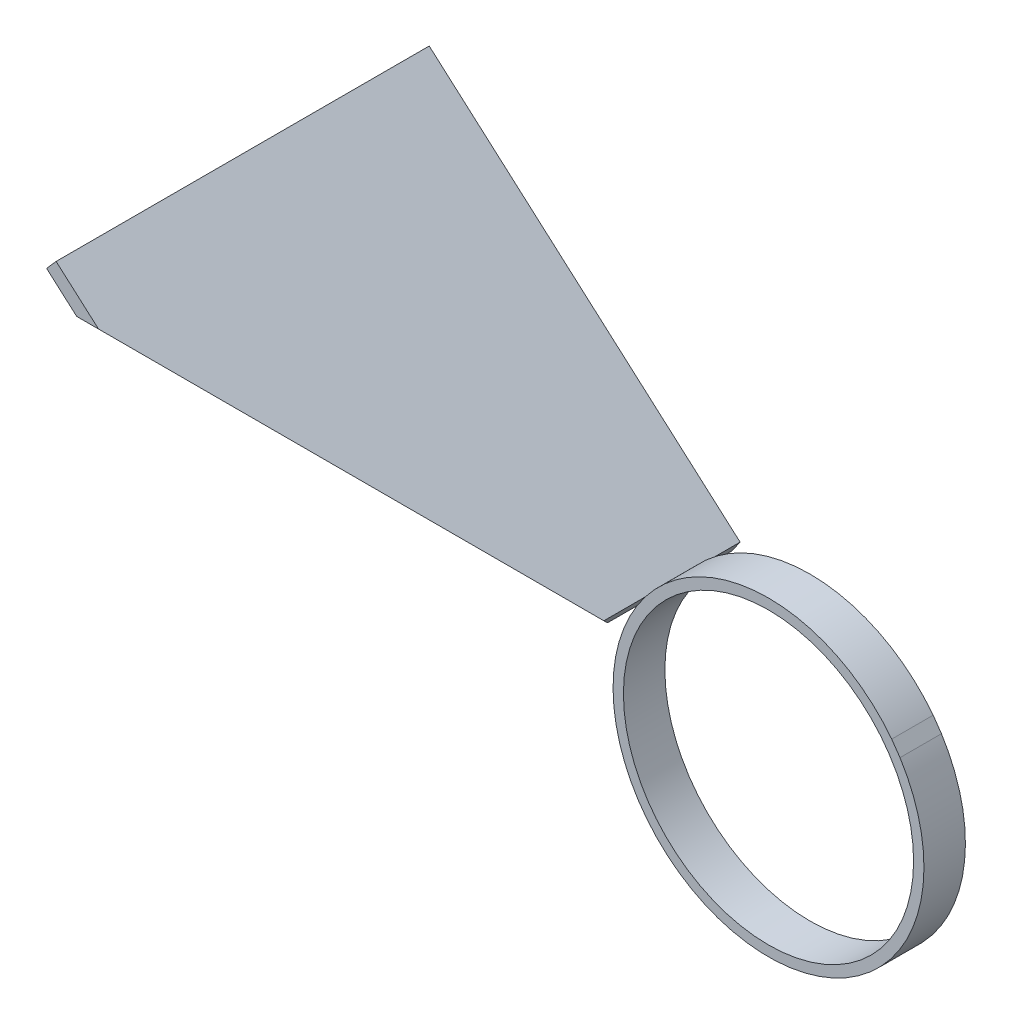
ISO-10303-21;
HEADER;
FILE_DESCRIPTION(('STEP AP214'),'2;1');
FILE_NAME('part.step','',(''),(''),'','','');
FILE_SCHEMA(('AUTOMOTIVE_DESIGN { 1 0 10303 214 1 1 1 1 }'));
ENDSEC;
DATA;
#1=APPLICATION_CONTEXT('core data for automotive mechanical design processes');
#2=APPLICATION_PROTOCOL_DEFINITION('international standard','automotive_design',2000,#1);
#3=PRODUCT_CONTEXT('',#1,'mechanical');
#4=PRODUCT('Part','Part','',(#3));
#5=PRODUCT_RELATED_PRODUCT_CATEGORY('part','',(#4));
#6=PRODUCT_DEFINITION_FORMATION('','',#4);
#7=PRODUCT_DEFINITION_CONTEXT('part definition',#1,'design');
#8=PRODUCT_DEFINITION('design','',#6,#7);
#9=PRODUCT_DEFINITION_SHAPE('','',#8);
#10=(LENGTH_UNIT() NAMED_UNIT(*) SI_UNIT(.MILLI.,.METRE.));
#11=(NAMED_UNIT(*) PLANE_ANGLE_UNIT() SI_UNIT($,.RADIAN.));
#12=(NAMED_UNIT(*) SI_UNIT($,.STERADIAN.) SOLID_ANGLE_UNIT());
#13=UNCERTAINTY_MEASURE_WITH_UNIT(LENGTH_MEASURE(1.E-05),#10,'distance_accuracy_value','');
#14=(GEOMETRIC_REPRESENTATION_CONTEXT(3) GLOBAL_UNCERTAINTY_ASSIGNED_CONTEXT((#13)) GLOBAL_UNIT_ASSIGNED_CONTEXT((#10,
#11,#12)) REPRESENTATION_CONTEXT('',''));
#15=CARTESIAN_POINT('',(0.,0.,0.));
#16=DIRECTION('',(0.,0.,1.));
#17=DIRECTION('',(1.,0.,0.));
#18=AXIS2_PLACEMENT_3D('',#15,#16,#17);
#19=CARTESIAN_POINT('',(-107.018779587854,86.4060082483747,-59.99));
#20=DIRECTION('',(0.661437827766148,0.75,0.));
#21=DIRECTION('',(-0.75,0.661437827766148,0.));
#22=AXIS2_PLACEMENT_3D('',#19,#20,#21);
#23=PLANE('',#22);
#24=DIRECTION('',(-0.75,0.661437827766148,0.));
#25=VECTOR('',#24,1.);
#26=CARTESIAN_POINT('',(-107.018779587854,86.4060082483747,-29.99));
#27=LINE('',#26,#25);
#28=CARTESIAN_POINT('',(-31.7214438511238,20.,-29.99));
#29=VERTEX_POINT('',#28);
#30=CARTESIAN_POINT('',(-107.018779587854,86.4060082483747,-29.99));
#31=VERTEX_POINT('',#30);
#32=EDGE_CURVE('E54',#29,#31,#27,.T.);
#33=ORIENTED_EDGE('',*,*,#32,.F.);
#34=DIRECTION('',(0.,0.,1.));
#35=VECTOR('',#34,1.);
#36=CARTESIAN_POINT('',(-31.7214438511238,20.,-59.99));
#37=LINE('',#36,#35);
#38=CARTESIAN_POINT('',(-31.7214438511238,20.,-17.12));
#39=VERTEX_POINT('',#38);
#40=EDGE_CURVE('E191',#29,#39,#37,.T.);
#41=ORIENTED_EDGE('',*,*,#40,.T.);
#42=CARTESIAN_POINT('',(-31.7214438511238,20.,-7.12));
#43=VERTEX_POINT('',#42);
#44=EDGE_CURVE('E195',#39,#43,#37,.T.);
#45=ORIENTED_EDGE('',*,*,#44,.T.);
#46=CARTESIAN_POINT('',(-31.7214438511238,20.,0.0100000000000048));
#47=VERTEX_POINT('',#46);
#48=EDGE_CURVE('E172',#43,#47,#37,.T.);
#49=ORIENTED_EDGE('',*,*,#48,.T.);
#50=DIRECTION('',(0.625543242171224,-0.551677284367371,-0.551677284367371));
#51=VECTOR('',#50,1.);
#52=CARTESIAN_POINT('',(-63.3963193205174,47.9346144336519,27.9446144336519));
#53=LINE('',#52,#51);
#54=CARTESIAN_POINT('',(-99.7550489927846,80.,60.01));
#55=VERTEX_POINT('',#54);
#56=EDGE_CURVE('E159',#55,#47,#53,.T.);
#57=ORIENTED_EDGE('',*,*,#56,.F.);
#58=DIRECTION('',(-0.75,0.661437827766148,0.));
#59=VECTOR('',#58,1.);
#60=CARTESIAN_POINT('',(-107.018779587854,86.4060082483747,60.01));
#61=LINE('',#60,#59);
#62=CARTESIAN_POINT('',(-107.018779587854,86.4060082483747,60.01));
#63=VERTEX_POINT('',#62);
#64=EDGE_CURVE('E169',#55,#63,#61,.T.);
#65=ORIENTED_EDGE('',*,*,#64,.T.);
#66=DIRECTION('',(0.,0.,1.));
#67=VECTOR('',#66,1.);
#68=CARTESIAN_POINT('',(-107.018779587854,86.4060082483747,-59.99));
#69=LINE('',#68,#67);
#70=EDGE_CURVE('E196',#31,#63,#69,.T.);
#71=ORIENTED_EDGE('',*,*,#70,.F.);
#72=EDGE_LOOP('',(#33,#41,#45,#49,#57,#65,#71));
#73=FACE_BOUND('',#72,.T.);
#74=ADVANCED_FACE('F39',(#73),#23,.F.);
#75=CARTESIAN_POINT('',(-29.7186463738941,22.8703313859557,-59.99));
#76=DIRECTION('',(-0.661437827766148,-0.75,0.));
#77=DIRECTION('',(0.75,-0.661437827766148,0.));
#78=AXIS2_PLACEMENT_3D('',#75,#76,#77);
#79=PLANE('',#78);
#80=DIRECTION('',(0.75,-0.661437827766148,0.));
#81=VECTOR('',#80,1.);
#82=CARTESIAN_POINT('',(-29.7186463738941,22.8703313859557,-29.99));
#83=LINE('',#82,#81);
#84=CARTESIAN_POINT('',(-104.718646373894,89.0141141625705,-29.99));
#85=VERTEX_POINT('',#84);
#86=CARTESIAN_POINT('',(-29.7186463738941,22.8703313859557,-29.99));
#87=VERTEX_POINT('',#86);
#88=EDGE_CURVE('E133',#85,#87,#83,.T.);
#89=ORIENTED_EDGE('',*,*,#88,.F.);
#90=DIRECTION('',(0.,0.,1.));
#91=VECTOR('',#90,1.);
#92=CARTESIAN_POINT('',(-104.718646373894,89.0141141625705,-59.99));
#93=LINE('',#92,#91);
#94=CARTESIAN_POINT('',(-104.718646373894,89.0141141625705,60.01));
#95=VERTEX_POINT('',#94);
#96=EDGE_CURVE('E199',#85,#95,#93,.T.);
#97=ORIENTED_EDGE('',*,*,#96,.T.);
#98=DIRECTION('',(0.75,-0.661437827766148,0.));
#99=VECTOR('',#98,1.);
#100=CARTESIAN_POINT('',(-29.7186463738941,22.8703313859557,60.01));
#101=LINE('',#100,#99);
#102=CARTESIAN_POINT('',(-94.4976016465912,80.,60.01));
#103=VERTEX_POINT('',#102);
#104=EDGE_CURVE('E174',#95,#103,#101,.T.);
#105=ORIENTED_EDGE('',*,*,#104,.T.);
#106=DIRECTION('',(-0.625543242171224,0.551677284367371,0.551677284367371));
#107=VECTOR('',#106,1.);
#108=CARTESIAN_POINT('',(-8.02222093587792,3.73588270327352,-16.2541172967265));
#109=LINE('',#108,#107);
#110=CARTESIAN_POINT('',(-29.7186463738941,22.8703313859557,2.88033138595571));
#111=VERTEX_POINT('',#110);
#112=EDGE_CURVE('E62',#111,#103,#109,.T.);
#113=ORIENTED_EDGE('',*,*,#112,.F.);
#114=DIRECTION('',(0.,0.,1.));
#115=VECTOR('',#114,1.);
#116=CARTESIAN_POINT('',(-29.7186463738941,22.8703313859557,-59.99));
#117=LINE('',#116,#115);
#118=CARTESIAN_POINT('',(-29.7186463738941,22.8703313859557,-7.12));
#119=VERTEX_POINT('',#118);
#120=EDGE_CURVE('E181',#119,#111,#117,.T.);
#121=ORIENTED_EDGE('',*,*,#120,.F.);
#122=CARTESIAN_POINT('',(-29.7186463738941,22.8703313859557,-17.12));
#123=VERTEX_POINT('',#122);
#124=EDGE_CURVE('E138',#123,#119,#117,.T.);
#125=ORIENTED_EDGE('',*,*,#124,.F.);
#126=EDGE_CURVE('E187',#87,#123,#117,.T.);
#127=ORIENTED_EDGE('',*,*,#126,.F.);
#128=EDGE_LOOP('',(#89,#97,#105,#113,#121,#125,#127));
#129=FACE_BOUND('',#128,.T.);
#130=ADVANCED_FACE('F229',(#129),#79,.F.);
#131=CARTESIAN_POINT('',(-31.7214438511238,20.,-59.99));
#132=DIRECTION('',(-0.82009468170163,0.572227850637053,0.));
#133=DIRECTION('',(-0.572227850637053,-0.820094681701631,0.));
#134=AXIS2_PLACEMENT_3D('',#131,#132,#133);
#135=PLANE('',#134);
#136=DIRECTION('',(-0.572227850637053,-0.820094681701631,0.));
#137=VECTOR('',#136,1.);
#138=CARTESIAN_POINT('',(-31.7214438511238,20.,-29.99));
#139=LINE('',#138,#137);
#140=EDGE_CURVE('E254',#87,#29,#139,.T.);
#141=ORIENTED_EDGE('',*,*,#140,.F.);
#142=ORIENTED_EDGE('',*,*,#126,.T.);
#143=DIRECTION('',(-0.572227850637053,-0.820094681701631,0.));
#144=VECTOR('',#143,1.);
#145=CARTESIAN_POINT('',(-30.720045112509,21.4351656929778,-17.12));
#146=LINE('',#145,#144);
#147=EDGE_CURVE('E194',#123,#39,#146,.T.);
#148=ORIENTED_EDGE('',*,*,#147,.T.);
#149=ORIENTED_EDGE('',*,*,#40,.F.);
#150=EDGE_LOOP('',(#141,#142,#148,#149));
#151=FACE_BOUND('',#150,.T.);
#152=ADVANCED_FACE('F234',(#151),#135,.F.);
#153=CARTESIAN_POINT('',(-104.718646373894,89.0141141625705,-59.99));
#154=DIRECTION('',(0.749999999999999,-0.661437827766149,0.));
#155=DIRECTION('',(0.661437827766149,0.749999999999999,0.));
#156=AXIS2_PLACEMENT_3D('',#153,#154,#155);
#157=PLANE('',#156);
#158=DIRECTION('',(0.661437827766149,0.749999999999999,0.));
#159=VECTOR('',#158,1.);
#160=CARTESIAN_POINT('',(-104.718646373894,89.0141141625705,-29.99));
#161=LINE('',#160,#159);
#162=EDGE_CURVE('E11',#31,#85,#161,.T.);
#163=ORIENTED_EDGE('',*,*,#162,.F.);
#164=ORIENTED_EDGE('',*,*,#70,.T.);
#165=DIRECTION('',(0.661437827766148,0.749999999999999,0.));
#166=VECTOR('',#165,1.);
#167=CARTESIAN_POINT('',(-104.718646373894,89.0141141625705,60.01));
#168=LINE('',#167,#166);
#169=EDGE_CURVE('E179',#63,#95,#168,.T.);
#170=ORIENTED_EDGE('',*,*,#169,.T.);
#171=ORIENTED_EDGE('',*,*,#96,.F.);
#172=EDGE_LOOP('',(#163,#164,#170,#171));
#173=FACE_BOUND('',#172,.T.);
#174=ADVANCED_FACE('F239',(#173),#157,.F.);
#175=DIRECTION('',(0.442464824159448,0.634123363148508,0.634123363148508));
#176=VECTOR('',#175,1.);
#177=CARTESIAN_POINT('',(-48.5560807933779,-4.12674638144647,-24.1167463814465));
#178=LINE('',#177,#176);
#179=EDGE_CURVE('E175',#47,#111,#178,.T.);
#180=ORIENTED_EDGE('',*,*,#179,.F.);
#181=ORIENTED_EDGE('',*,*,#48,.F.);
#182=DIRECTION('',(-0.572227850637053,-0.820094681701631,0.));
#183=VECTOR('',#182,1.);
#184=CARTESIAN_POINT('',(-30.720045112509,21.4351656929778,-7.12));
#185=LINE('',#184,#183);
#186=EDGE_CURVE('E154',#119,#43,#185,.T.);
#187=ORIENTED_EDGE('',*,*,#186,.F.);
#188=ORIENTED_EDGE('',*,*,#120,.T.);
#189=EDGE_LOOP('',(#180,#181,#187,#188));
#190=FACE_BOUND('',#189,.T.);
#191=ADVANCED_FACE('F241',(#190),#135,.F.);
#192=CARTESIAN_POINT('',(0.,0.,60.01));
#193=DIRECTION('',(0.,0.,-1.));
#194=DIRECTION('',(1.,0.,0.));
#195=AXIS2_PLACEMENT_3D('',#192,#193,#194);
#196=PLANE('',#195);
#197=DIRECTION('',(-1.,0.,0.));
#198=VECTOR('',#197,1.);
#199=CARTESIAN_POINT('',(0.,80.,60.01));
#200=LINE('',#199,#198);
#201=EDGE_CURVE('E48',#103,#55,#200,.T.);
#202=ORIENTED_EDGE('',*,*,#201,.F.);
#203=ORIENTED_EDGE('',*,*,#104,.F.);
#204=ORIENTED_EDGE('',*,*,#169,.F.);
#205=ORIENTED_EDGE('',*,*,#64,.F.);
#206=EDGE_LOOP('',(#202,#203,#204,#205));
#207=FACE_BOUND('',#206,.T.);
#208=ADVANCED_FACE('F177',(#207),#196,.F.);
#209=CARTESIAN_POINT('',(0.,0.,-17.12));
#210=DIRECTION('',(0.,0.,1.));
#211=DIRECTION('',(1.,0.,0.));
#212=AXIS2_PLACEMENT_3D('',#209,#210,#211);
#213=CYLINDRICAL_SURFACE('',#212,37.5);
#214=CARTESIAN_POINT('',(0.,0.,-7.12));
#215=DIRECTION('',(0.,0.,1.));
#216=DIRECTION('',(1.,0.,0.));
#217=AXIS2_PLACEMENT_3D('',#214,#215,#216);
#218=CIRCLE('',#217,37.5);
#219=CARTESIAN_POINT('',(31.7214438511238,20.,-7.12));
#220=VERTEX_POINT('',#219);
#221=EDGE_CURVE('E130',#43,#220,#218,.T.);
#222=ORIENTED_EDGE('',*,*,#221,.F.);
#223=ORIENTED_EDGE('',*,*,#44,.F.);
#224=CARTESIAN_POINT('',(0.,0.,-17.12));
#225=DIRECTION('',(0.,0.,1.));
#226=DIRECTION('',(1.,0.,0.));
#227=AXIS2_PLACEMENT_3D('',#224,#225,#226);
#228=CIRCLE('',#227,37.5);
#229=CARTESIAN_POINT('',(31.7214438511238,20.,-17.12));
#230=VERTEX_POINT('',#229);
#231=EDGE_CURVE('E140',#39,#230,#228,.T.);
#232=ORIENTED_EDGE('',*,*,#231,.T.);
#233=DIRECTION('',(0.,0.,1.));
#234=VECTOR('',#233,1.);
#235=CARTESIAN_POINT('',(31.7214438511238,20.,-59.99));
#236=LINE('',#235,#234);
#237=EDGE_CURVE('E121',#230,#220,#236,.T.);
#238=ORIENTED_EDGE('',*,*,#237,.T.);
#239=EDGE_LOOP('',(#222,#223,#232,#238));
#240=FACE_BOUND('',#239,.T.);
#241=ADVANCED_FACE('F41',(#240),#213,.T.);
#242=CARTESIAN_POINT('',(29.7186463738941,22.8703313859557,-17.12));
#243=VERTEX_POINT('',#242);
#244=EDGE_CURVE('E145',#243,#123,#228,.T.);
#245=ORIENTED_EDGE('',*,*,#244,.T.);
#246=ORIENTED_EDGE('',*,*,#124,.T.);
#247=CARTESIAN_POINT('',(29.7186463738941,22.8703313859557,-7.12));
#248=VERTEX_POINT('',#247);
#249=EDGE_CURVE('E128',#248,#119,#218,.T.);
#250=ORIENTED_EDGE('',*,*,#249,.F.);
#251=DIRECTION('',(0.,0.,1.));
#252=VECTOR('',#251,1.);
#253=CARTESIAN_POINT('',(29.7186463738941,22.8703313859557,-17.12));
#254=LINE('',#253,#252);
#255=EDGE_CURVE('E109',#248,#243,#254,.F.);
#256=ORIENTED_EDGE('',*,*,#255,.T.);
#257=EDGE_LOOP('',(#245,#246,#250,#256));
#258=FACE_BOUND('',#257,.T.);
#259=ADVANCED_FACE('F136',(#258),#213,.T.);
#260=CARTESIAN_POINT('',(0.,0.,-17.12));
#261=DIRECTION('',(0.,0.,1.));
#262=DIRECTION('',(1.,0.,0.));
#263=AXIS2_PLACEMENT_3D('',#260,#261,#262);
#264=PLANE('',#263);
#265=CARTESIAN_POINT('',(0.,0.,-17.12));
#266=DIRECTION('',(0.,0.,1.));
#267=DIRECTION('',(1.,0.,0.));
#268=AXIS2_PLACEMENT_3D('',#265,#266,#267);
#269=CIRCLE('',#268,35.);
#270=CARTESIAN_POINT('',(35.,0.,-17.12));
#271=VERTEX_POINT('',#270);
#272=EDGE_CURVE('E147',#271,#271,#269,.T.);
#273=ORIENTED_EDGE('',*,*,#272,.T.);
#274=EDGE_LOOP('',(#273));
#275=FACE_BOUND('',#274,.T.);
#276=ORIENTED_EDGE('',*,*,#147,.F.);
#277=ORIENTED_EDGE('',*,*,#244,.F.);
#278=DIRECTION('',(-0.572227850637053,0.820094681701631,0.));
#279=VECTOR('',#278,1.);
#280=CARTESIAN_POINT('',(31.7214438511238,20.,-17.12));
#281=LINE('',#280,#279);
#282=EDGE_CURVE('E115',#230,#243,#281,.T.);
#283=ORIENTED_EDGE('',*,*,#282,.F.);
#284=ORIENTED_EDGE('',*,*,#231,.F.);
#285=EDGE_LOOP('',(#276,#277,#283,#284));
#286=FACE_BOUND('',#285,.T.);
#287=ADVANCED_FACE('F213',(#275,#286),#264,.F.);
#288=CARTESIAN_POINT('',(0.,0.,-7.12));
#289=DIRECTION('',(0.,0.,1.));
#290=DIRECTION('',(1.,0.,0.));
#291=AXIS2_PLACEMENT_3D('',#288,#289,#290);
#292=PLANE('',#291);
#293=DIRECTION('',(0.572227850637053,-0.82009468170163,0.));
#294=VECTOR('',#293,1.);
#295=CARTESIAN_POINT('',(31.7214438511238,20.,-7.12));
#296=LINE('',#295,#294);
#297=EDGE_CURVE('E112',#248,#220,#296,.T.);
#298=ORIENTED_EDGE('',*,*,#297,.F.);
#299=ORIENTED_EDGE('',*,*,#249,.T.);
#300=ORIENTED_EDGE('',*,*,#186,.T.);
#301=ORIENTED_EDGE('',*,*,#221,.T.);
#302=EDGE_LOOP('',(#298,#299,#300,#301));
#303=FACE_BOUND('',#302,.T.);
#304=CARTESIAN_POINT('',(0.,0.,-7.12));
#305=DIRECTION('',(0.,0.,1.));
#306=DIRECTION('',(1.,0.,0.));
#307=AXIS2_PLACEMENT_3D('',#304,#305,#306);
#308=CIRCLE('',#307,35.);
#309=CARTESIAN_POINT('',(35.,0.,-7.12));
#310=VERTEX_POINT('',#309);
#311=EDGE_CURVE('E206',#310,#310,#308,.T.);
#312=ORIENTED_EDGE('',*,*,#311,.F.);
#313=EDGE_LOOP('',(#312));
#314=FACE_BOUND('',#313,.T.);
#315=ADVANCED_FACE('F125',(#303,#314),#292,.T.);
#316=CARTESIAN_POINT('',(0.,0.,-29.99));
#317=DIRECTION('',(0.,0.,1.));
#318=DIRECTION('',(1.,0.,0.));
#319=AXIS2_PLACEMENT_3D('',#316,#317,#318);
#320=CYLINDRICAL_SURFACE('',#319,35.);
#321=ORIENTED_EDGE('',*,*,#311,.T.);
#322=EDGE_LOOP('',(#321));
#323=FACE_BOUND('',#322,.T.);
#324=ORIENTED_EDGE('',*,*,#272,.F.);
#325=EDGE_LOOP('',(#324));
#326=FACE_BOUND('',#325,.T.);
#327=ADVANCED_FACE('F216',(#323,#326),#320,.F.);
#328=CARTESIAN_POINT('',(-7.01877958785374,20.,0.0100000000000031));
#329=DIRECTION('',(0.,-0.707106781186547,0.707106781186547));
#330=DIRECTION('',(0.,-0.707106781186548,-0.707106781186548));
#331=AXIS2_PLACEMENT_3D('',#328,#329,#330);
#332=PLANE('',#331);
#333=ORIENTED_EDGE('',*,*,#56,.T.);
#334=ORIENTED_EDGE('',*,*,#179,.T.);
#335=ORIENTED_EDGE('',*,*,#112,.T.);
#336=ORIENTED_EDGE('',*,*,#201,.T.);
#337=EDGE_LOOP('',(#333,#334,#335,#336));
#338=FACE_BOUND('',#337,.T.);
#339=ADVANCED_FACE('F158',(#338),#332,.T.);
#340=CARTESIAN_POINT('',(-7.01877958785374,20.,-29.99));
#341=DIRECTION('',(0.,0.,-1.));
#342=DIRECTION('',(-1.,0.,0.));
#343=AXIS2_PLACEMENT_3D('',#340,#341,#342);
#344=PLANE('',#343);
#345=ORIENTED_EDGE('',*,*,#140,.T.);
#346=ORIENTED_EDGE('',*,*,#32,.T.);
#347=ORIENTED_EDGE('',*,*,#162,.T.);
#348=ORIENTED_EDGE('',*,*,#88,.T.);
#349=EDGE_LOOP('',(#345,#346,#347,#348));
#350=FACE_BOUND('',#349,.T.);
#351=ADVANCED_FACE('F224',(#350),#344,.T.);
#352=CARTESIAN_POINT('',(31.7214438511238,20.,-29.99));
#353=DIRECTION('',(-0.82009468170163,-0.572227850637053,0.));
#354=DIRECTION('',(0.572227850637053,-0.82009468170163,0.));
#355=AXIS2_PLACEMENT_3D('',#352,#353,#354);
#356=PLANE('',#355);
#357=ORIENTED_EDGE('',*,*,#255,.F.);
#358=ORIENTED_EDGE('',*,*,#297,.T.);
#359=ORIENTED_EDGE('',*,*,#237,.F.);
#360=ORIENTED_EDGE('',*,*,#282,.T.);
#361=EDGE_LOOP('',(#357,#358,#359,#360));
#362=FACE_BOUND('',#361,.T.);
#363=ADVANCED_FACE('F111',(#362),#356,.F.);
#364=CLOSED_SHELL('',(#74,#130,#152,#174,#191,#208,#241,#259,#287,#315,#327,#339,#351,#363));
#365=MANIFOLD_SOLID_BREP('B2',#364);
#366=ADVANCED_BREP_SHAPE_REPRESENTATION('',(#18,#365),#14);
#367=SHAPE_DEFINITION_REPRESENTATION(#9,#366);
ENDSEC;
END-ISO-10303-21;
